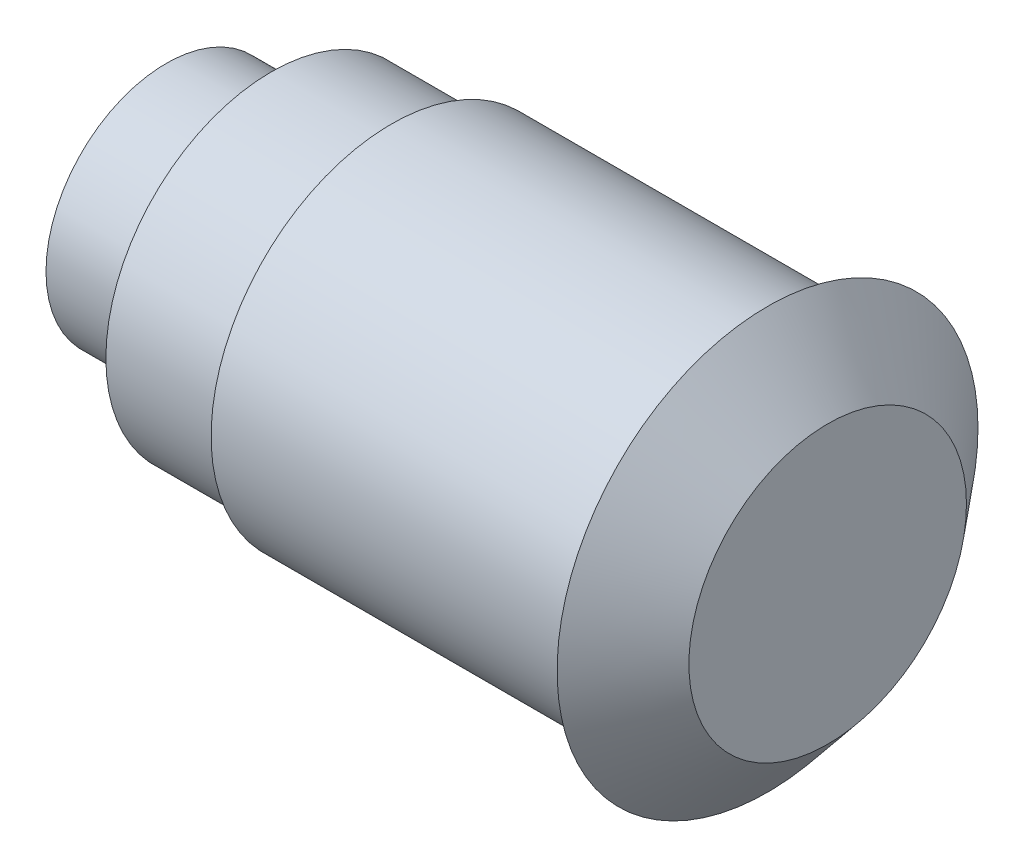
from build123d import *


with BuildPart() as part:
    # Esquisse1 → R_volution1 (revolve)
    with BuildSketch(Plane.XY, mode=Mode.PRIVATE) as r_volution1_sk:
        Polygon((2, 0), (2, 4.616492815), (0, 7), (0, 6), (-12.508395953, 6), (-12.712302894, 5.5), (-16.508395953, 5.5), (-17.120116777, 4), (-20, 4), (-20, 2.842685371), (-17.120116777, 2.842685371), (-17.120116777, 0), align=None)
    revolve(r_volution1_sk.sketch.rotate(Axis((0, 0, 0), (-1, 0, 0)), 90), axis=Axis((0, 0, 0), (-1, 0, 0)))


solid = part.part
